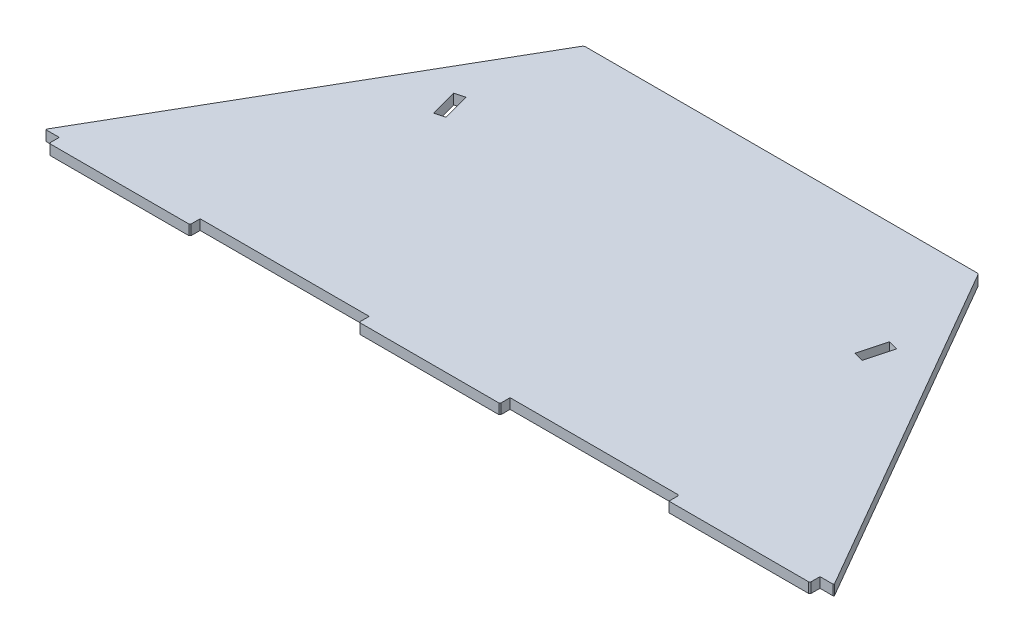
from build123d import *
from OCP.BRepFilletAPI import BRepFilletAPI_MakeChamfer

# Parameters (mm, degrees)
SALIENTE_EXTRUIR1_DEPTH = 18
CROQUIS2_W              = 1400
CROQUIS2_H              = 606.217782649
CORTAR_EXTRUIR1_DEPTH   = 927.187885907
CROQUIS3_W              = 250
CROQUIS3_H              = 18
SALIENTE_EXTRUIR2_DEPTH = 18
CORTAR_EXTRUIR2_DEPTH   = 927.187885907
REDONDEO1_R             = 5
CHAFL_N1_SIZE           = 2
CHAFL_N1_SIZE2          = 1.464101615


with BuildPart() as part:
    # Croquis1 → Saliente-Extruir1 (new body)
    with BuildSketch(Plane(origin=(0, 0, 0), x_dir=(1, 0, 0), z_dir=(0, 1, 0))):
        Polygon((350, 606.217782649), (-350, 606.217782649), (-700, 0), (-350, -606.217782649), (350, -606.217782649), (700, 0), align=None)
    extrude(amount=SALIENTE_EXTRUIR1_DEPTH)

    # Croquis2 → Cortar-Extruir1 (cut, through all)
    with BuildSketch(Plane(origin=(0, 18, 0), x_dir=(1, 0, 0), z_dir=(0, 1, 0))):
        with Locations((0, -303.108891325)):
            Rectangle(CROQUIS2_W, CROQUIS2_H)
    extrude(amount=-CORTAR_EXTRUIR1_DEPTH, mode=Mode.SUBTRACT)

    # Croquis3 → Saliente-Extruir2 (add, through all)
    with BuildSketch(Plane(origin=(0, 18, 0), x_dir=(1, 0, 0), z_dir=(0, 1, 0))):
        with Locations((-550, -9)):
            Rectangle(CROQUIS3_W, CROQUIS3_H)
        with Locations((0, -9)):
            Rectangle(CROQUIS3_W, CROQUIS3_H)
        with Locations((550, -9)):
            Rectangle(CROQUIS3_W, CROQUIS3_H)
    extrude(amount=-SALIENTE_EXTRUIR2_DEPTH)

    # Croquis4 → Cortar-Extruir2 (cut, through all)
    with BuildSketch(Plane.XZ):
        Polygon((-375.60395953, -422.525722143), (-392.990624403, -417.866979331), (-380.049672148, -369.570688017), (-362.663007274, -374.229430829), align=None)
        Polygon((362.663007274, -374.229430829), (375.60395953, -422.525722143), (392.990624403, -417.866979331), (380.049672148, -369.570688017), align=None)
    extrude(amount=-CORTAR_EXTRUIR2_DEPTH, mode=Mode.SUBTRACT)

    # Redondeo1
    redondeo1_edges = [part.edges().sort_by_distance(p)[0] for p in [
        (-350, 9, -606.217782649),
        (350, 9, -606.217782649),
    ]]
    fillet(redondeo1_edges, radius=REDONDEO1_R)

    # Chafl_n1: one chamfer whose edges measure the first distance from different faces: ONE call of the kernel's chamfer builder (chamfer() names one face for all edges)
    chafl_n1_edges_1 = [part.edges().sort_by_distance(p)[0] for p in [
        (700, 9, 0),
    ]]
    chafl_n1_side_1 = [part.faces().sort_by_distance(p)[0] for p in [
        (687.5, 9, 0),
    ]]
    chafl_n1_edges_2 = [part.edges().sort_by_distance(p)[0] for p in [
        (-700, 9, 0),
    ]]
    chafl_n1_side_2 = [part.faces().sort_by_distance(p)[0] for p in [
        (-525.721687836, 9, -301.858891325),
    ]]
    chafl_n1_edges_3 = [part.edges().sort_by_distance(p)[0] for p in [
        (-675, 9, 18),
        (-425, 9, 18),
        (-125, 9, 18),
        (125, 9, 18),
        (425, 9, 0),
        (675, 9, 18),
    ]]
    chafl_n1 = BRepFilletAPI_MakeChamfer(part.part.solid().wrapped)
    for e in chafl_n1_edges_1:
        chafl_n1.Add(CHAFL_N1_SIZE, CHAFL_N1_SIZE2, e.wrapped, chafl_n1_side_1[0].wrapped)  # the first distance lies on this face
    for e in chafl_n1_edges_2:
        chafl_n1.Add(CHAFL_N1_SIZE, CHAFL_N1_SIZE2, e.wrapped, chafl_n1_side_2[0].wrapped)  # the first distance lies on this face
    for e in chafl_n1_edges_3:
        chafl_n1.Add(CHAFL_N1_SIZE, e.wrapped)
    add(Compound.cast(chafl_n1.Shape()), mode=Mode.REPLACE)


solid = part.part
